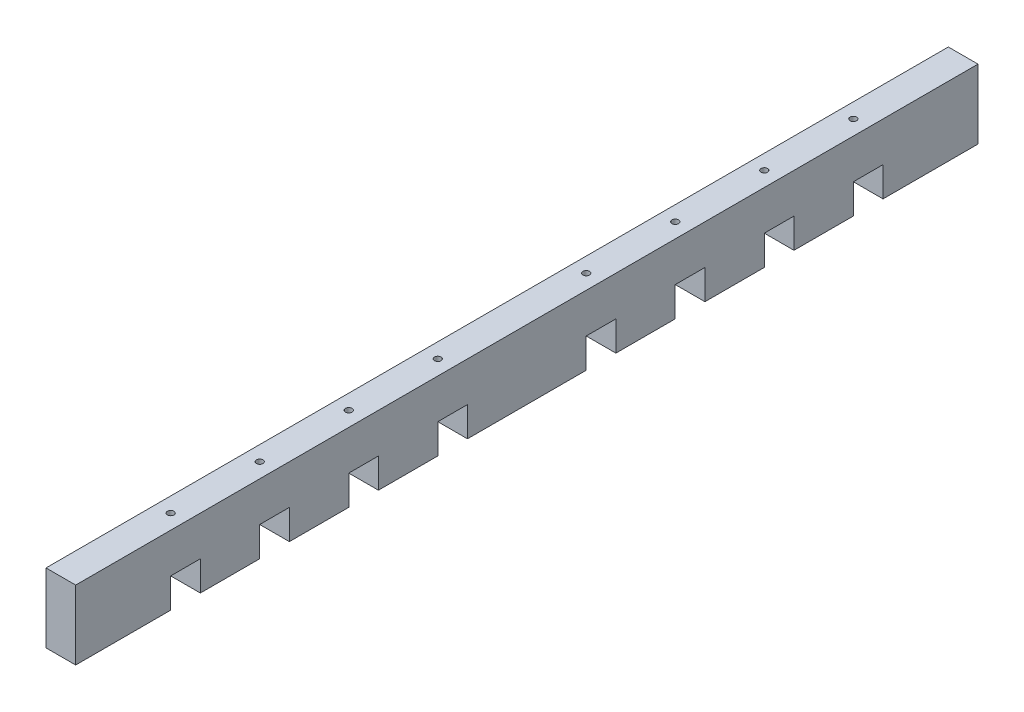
from build123d import *

# Parameters (mm, degrees)
ESQUISSE1_W                = 15
ESQUISSE1_H                = 35
BOSS_EXTRU_1_DEPTH         = 228
ESQUISSE2_W                = 15
ESQUISSE2_H                = 15
ENL_V_MAT_EXTRU_1_DEPTH    = 232.157954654
TROU_TARAUD_M41_D          = 3.3
R_P_TITION_LIN_AIRE1_COUNT = 4
R_P_TITION_LIN_AIRE1_PITCH = 45
SYM_TRIE1_COPY_1_SKETCH_W  = 15
SYM_TRIE1_COPY_1_SKETCH_H  = 15
SYM_TRIE1_COPY_1_DEPTH     = 232.157954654
SYM_TRIE1_COPY_2_SKETCH_W  = 15
SYM_TRIE1_COPY_2_SKETCH_H  = 15
SYM_TRIE1_COPY_2_DEPTH     = 232.157954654
SYM_TRIE1_COPY_3_SKETCH_W  = 15
SYM_TRIE1_COPY_3_SKETCH_H  = 15
SYM_TRIE1_COPY_3_DEPTH     = 232.157954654
SYM_TRIE1_COPY_4_D         = 3.3
SYM_TRIE1_COPY_5_D         = 3.3
SYM_TRIE1_COPY_6_D         = 3.3


with BuildPart() as part:
    # Esquisse1 → Boss.-Extru.1 (new, symmetric)
    with BuildSketch(Plane.XY):
        with Locations((-7.5, 17.5)):
            Rectangle(ESQUISSE1_W, ESQUISSE1_H)
    extrude(amount=BOSS_EXTRU_1_DEPTH, both=True)

    # Esquisse2 → Enl_v. mat.-Extru.1 (cut, through all)
    with BuildSketch(Plane(origin=(0, 0, 0), x_dir=(0, 0, -1), z_dir=(1, 0, 0))):
        with Locations((-37.5, 7.5)):
            Rectangle(ESQUISSE2_W, ESQUISSE2_H)
    enl_v_mat_extru_1 = extrude(amount=-ENL_V_MAT_EXTRU_1_DEPTH, mode=Mode.SUBTRACT)

    # Trou taraud_ M41 (through all)
    with Locations(Plane.XZ.offset(-15)):
        with Locations((-7.5, 37.5)):
            trou_taraud_m41 = Hole(TROU_TARAUD_M41_D / 2)

    # R_p_tition lin_aire1: Enl_v. mat.-Extru.1, Trou taraud_ M41 ×4
    with Locations(*[(0, 0, i * R_P_TITION_LIN_AIRE1_PITCH) for i in range(1, R_P_TITION_LIN_AIRE1_COUNT)]):
        add(enl_v_mat_extru_1, mode=Mode.SUBTRACT)
        add(trou_taraud_m41, mode=Mode.SUBTRACT)

    # Sym_trie1: Enl_v. mat.-Extru.1, Trou taraud_ M41 across plane
    add(enl_v_mat_extru_1.mirror(Plane.XY), mode=Mode.SUBTRACT)
    add(trou_taraud_m41.mirror(Plane.XY), mode=Mode.SUBTRACT)

    # Sym_trie1 copy 1 sketch → Sym_trie1 copy 1 (cut, through all)
    with BuildSketch(Plane(origin=(0, 0, -45), x_dir=(0, 0, 1), z_dir=(1, 0, 0))):
        with Locations((-37.5, -7.5)):
            Rectangle(SYM_TRIE1_COPY_1_SKETCH_W, SYM_TRIE1_COPY_1_SKETCH_H)
    extrude(amount=-SYM_TRIE1_COPY_1_DEPTH, mode=Mode.SUBTRACT)

    # Sym_trie1 copy 2 sketch → Sym_trie1 copy 2 (cut, through all)
    with BuildSketch(Plane(origin=(0, 0, -90), x_dir=(0, 0, 1), z_dir=(1, 0, 0))):
        with Locations((-37.5, -7.5)):
            Rectangle(SYM_TRIE1_COPY_2_SKETCH_W, SYM_TRIE1_COPY_2_SKETCH_H)
    extrude(amount=-SYM_TRIE1_COPY_2_DEPTH, mode=Mode.SUBTRACT)

    # Sym_trie1 copy 3 sketch → Sym_trie1 copy 3 (cut, through all)
    with BuildSketch(Plane(origin=(0, 0, -135), x_dir=(0, 0, 1), z_dir=(1, 0, 0))):
        with Locations((-37.5, -7.5)):
            Rectangle(SYM_TRIE1_COPY_3_SKETCH_W, SYM_TRIE1_COPY_3_SKETCH_H)
    extrude(amount=-SYM_TRIE1_COPY_3_DEPTH, mode=Mode.SUBTRACT)

    # Sym_trie1 copy 4 (through all)
    with Locations(Plane(origin=(0, 15, -45), x_dir=(1, 0, 0), z_dir=(0, -1, 0))):
        with Locations((-7.5, -37.5)):
            Hole(SYM_TRIE1_COPY_4_D / 2)

    # Sym_trie1 copy 5 (through all)
    with Locations(Plane(origin=(0, 15, -90), x_dir=(1, 0, 0), z_dir=(0, -1, 0))):
        with Locations((-7.5, -37.5)):
            Hole(SYM_TRIE1_COPY_5_D / 2)

    # Sym_trie1 copy 6 (through all)
    with Locations(Plane(origin=(0, 15, -135), x_dir=(1, 0, 0), z_dir=(0, -1, 0))):
        with Locations((-7.5, -37.5)):
            Hole(SYM_TRIE1_COPY_6_D / 2)


solid = part.part
